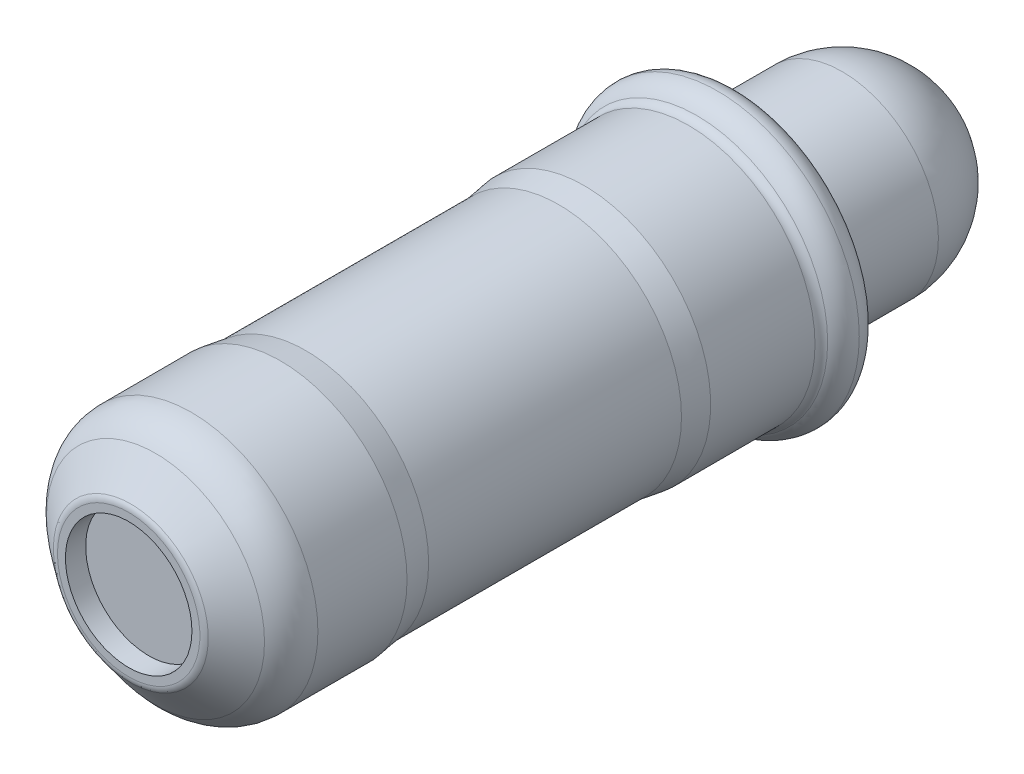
ISO-10303-21;
HEADER;
FILE_DESCRIPTION(('STEP AP214'),'2;1');
FILE_NAME('part.step','',(''),(''),'','','');
FILE_SCHEMA(('AUTOMOTIVE_DESIGN { 1 0 10303 214 1 1 1 1 }'));
ENDSEC;
DATA;
#1=APPLICATION_CONTEXT('core data for automotive mechanical design processes');
#2=APPLICATION_PROTOCOL_DEFINITION('international standard','automotive_design',2000,#1);
#3=PRODUCT_CONTEXT('',#1,'mechanical');
#4=PRODUCT('Part','Part','',(#3));
#5=PRODUCT_RELATED_PRODUCT_CATEGORY('part','',(#4));
#6=PRODUCT_DEFINITION_FORMATION('','',#4);
#7=PRODUCT_DEFINITION_CONTEXT('part definition',#1,'design');
#8=PRODUCT_DEFINITION('design','',#6,#7);
#9=PRODUCT_DEFINITION_SHAPE('','',#8);
#10=(LENGTH_UNIT() NAMED_UNIT(*) SI_UNIT(.MILLI.,.METRE.));
#11=(NAMED_UNIT(*) PLANE_ANGLE_UNIT() SI_UNIT($,.RADIAN.));
#12=(NAMED_UNIT(*) SI_UNIT($,.STERADIAN.) SOLID_ANGLE_UNIT());
#13=UNCERTAINTY_MEASURE_WITH_UNIT(LENGTH_MEASURE(1.E-05),#10,'distance_accuracy_value','');
#14=(GEOMETRIC_REPRESENTATION_CONTEXT(3) GLOBAL_UNCERTAINTY_ASSIGNED_CONTEXT((#13)) GLOBAL_UNIT_ASSIGNED_CONTEXT((#10,
#11,#12)) REPRESENTATION_CONTEXT('',''));
#15=CARTESIAN_POINT('',(0.,0.,0.));
#16=DIRECTION('',(0.,0.,1.));
#17=DIRECTION('',(1.,0.,0.));
#18=AXIS2_PLACEMENT_3D('',#15,#16,#17);
#19=CARTESIAN_POINT('',(0.,0.,4.));
#20=DIRECTION('',(0.,0.,1.));
#21=DIRECTION('',(1.,0.,0.));
#22=AXIS2_PLACEMENT_3D('',#19,#20,#21);
#23=CYLINDRICAL_SURFACE('',#22,1.25);
#24=CARTESIAN_POINT('',(0.,0.,16.));
#25=DIRECTION('',(0.,0.,1.));
#26=DIRECTION('',(1.,0.,0.));
#27=AXIS2_PLACEMENT_3D('',#24,#25,#26);
#28=CIRCLE('',#27,1.25);
#29=CARTESIAN_POINT('',(1.25,0.,16.));
#30=VERTEX_POINT('',#29);
#31=EDGE_CURVE('E154',#30,#30,#28,.F.);
#32=ORIENTED_EDGE('',*,*,#31,.F.);
#33=EDGE_LOOP('',(#32));
#34=FACE_BOUND('',#33,.T.);
#35=CARTESIAN_POINT('',(0.,0.,15.6));
#36=DIRECTION('',(0.,0.,1.));
#37=DIRECTION('',(1.,0.,0.));
#38=AXIS2_PLACEMENT_3D('',#35,#36,#37);
#39=CIRCLE('',#38,1.25);
#40=CARTESIAN_POINT('',(1.25,0.,15.6));
#41=VERTEX_POINT('',#40);
#42=EDGE_CURVE('E161',#41,#41,#39,.T.);
#43=ORIENTED_EDGE('',*,*,#42,.F.);
#44=EDGE_LOOP('',(#43));
#45=FACE_BOUND('',#44,.T.);
#46=ADVANCED_FACE('F12',(#34,#45),#23,.F.);
#47=CARTESIAN_POINT('',(0.,1.89,4.));
#48=DIRECTION('',(0.,0.,-1.));
#49=DIRECTION('',(-1.,0.,0.));
#50=AXIS2_PLACEMENT_3D('',#47,#48,#49);
#51=PLANE('',#50);
#52=CARTESIAN_POINT('',(0.,0.,4.));
#53=DIRECTION('',(0.,0.,-1.));
#54=DIRECTION('',(-1.,0.,0.));
#55=AXIS2_PLACEMENT_3D('',#52,#53,#54);
#56=CIRCLE('',#55,1.9);
#57=CARTESIAN_POINT('',(-1.9,0.,4.));
#58=VERTEX_POINT('',#57);
#59=EDGE_CURVE('E15',#58,#58,#56,.F.);
#60=ORIENTED_EDGE('',*,*,#59,.T.);
#61=EDGE_LOOP('',(#60));
#62=FACE_BOUND('',#61,.T.);
#63=CARTESIAN_POINT('',(0.,0.,4.00000000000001));
#64=DIRECTION('',(0.,0.,1.));
#65=DIRECTION('',(-1.,0.,0.));
#66=AXIS2_PLACEMENT_3D('',#63,#64,#65);
#67=CIRCLE('',#66,2.53126609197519);
#68=CARTESIAN_POINT('',(-2.53126609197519,0.,4.00000000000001));
#69=VERTEX_POINT('',#68);
#70=EDGE_CURVE('E150',#69,#69,#67,.T.);
#71=ORIENTED_EDGE('',*,*,#70,.F.);
#72=EDGE_LOOP('',(#71));
#73=FACE_BOUND('',#72,.T.);
#74=ADVANCED_FACE('F132',(#62,#73),#51,.T.);
#75=CARTESIAN_POINT('',(0.,1.4071811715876,16.));
#76=DIRECTION('',(0.,0.,1.));
#77=DIRECTION('',(1.,0.,0.));
#78=AXIS2_PLACEMENT_3D('',#75,#76,#77);
#79=PLANE('',#78);
#80=CARTESIAN_POINT('',(0.,0.,16.));
#81=DIRECTION('',(0.,0.,-1.));
#82=DIRECTION('',(-1.,0.,0.));
#83=AXIS2_PLACEMENT_3D('',#80,#81,#82);
#84=CIRCLE('',#83,1.40718117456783);
#85=CARTESIAN_POINT('',(-1.40718117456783,0.,16.));
#86=VERTEX_POINT('',#85);
#87=EDGE_CURVE('E120',#86,#86,#84,.T.);
#88=ORIENTED_EDGE('',*,*,#87,.F.);
#89=EDGE_LOOP('',(#88));
#90=FACE_BOUND('',#89,.T.);
#91=ORIENTED_EDGE('',*,*,#31,.T.);
#92=EDGE_LOOP('',(#91));
#93=FACE_BOUND('',#92,.T.);
#94=ADVANCED_FACE('F124',(#90,#93),#79,.T.);
#95=CARTESIAN_POINT('',(0.,0.,4.1999999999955));
#96=DIRECTION('',(0.,0.,-1.));
#97=DIRECTION('',(-1.,0.,0.));
#98=AXIS2_PLACEMENT_3D('',#95,#96,#97);
#99=TOROIDAL_SURFACE('',#98,2.53126743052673,0.199999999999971);
#100=ORIENTED_EDGE('',*,*,#70,.T.);
#101=EDGE_LOOP('',(#100));
#102=FACE_BOUND('',#101,.T.);
#103=CARTESIAN_POINT('',(0.,0.,4.059));
#104=DIRECTION('',(0.,0.,-1.));
#105=DIRECTION('',(-1.,0.,0.));
#106=AXIS2_PLACEMENT_3D('',#103,#104,#105);
#107=CIRCLE('',#106,2.67310889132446);
#108=CARTESIAN_POINT('',(-2.67310889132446,0.,4.059));
#109=VERTEX_POINT('',#108);
#110=EDGE_CURVE('E89',#109,#109,#107,.F.);
#111=ORIENTED_EDGE('',*,*,#110,.F.);
#112=EDGE_LOOP('',(#111));
#113=FACE_BOUND('',#112,.T.);
#114=ADVANCED_FACE('F106',(#102,#113),#99,.T.);
#115=CARTESIAN_POINT('',(0.,0.,15.8));
#116=DIRECTION('',(0.,0.,-1.));
#117=DIRECTION('',(-1.,0.,0.));
#118=AXIS2_PLACEMENT_3D('',#115,#116,#117);
#119=TOROIDAL_SURFACE('',#118,1.4071811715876,0.2);
#120=CARTESIAN_POINT('',(0.,0.,15.9576021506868));
#121=DIRECTION('',(0.,0.,-1.));
#122=DIRECTION('',(-1.,0.,0.));
#123=AXIS2_PLACEMENT_3D('',#120,#121,#122);
#124=CIRCLE('',#123,1.53031346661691);
#125=CARTESIAN_POINT('',(-1.53031346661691,0.,15.9576021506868));
#126=VERTEX_POINT('',#125);
#127=EDGE_CURVE('E84',#126,#126,#124,.T.);
#128=ORIENTED_EDGE('',*,*,#127,.F.);
#129=EDGE_LOOP('',(#128));
#130=FACE_BOUND('',#129,.T.);
#131=ORIENTED_EDGE('',*,*,#87,.T.);
#132=EDGE_LOOP('',(#131));
#133=FACE_BOUND('',#132,.T.);
#134=ADVANCED_FACE('F100',(#130,#133),#119,.T.);
#135=CARTESIAN_POINT('',(0.,0.,4.364));
#136=DIRECTION('',(0.,0.,-1.));
#137=DIRECTION('',(-1.,0.,0.));
#138=AXIS2_PLACEMENT_3D('',#135,#136,#137);
#139=TOROIDAL_SURFACE('',#138,2.37,0.43);
#140=ORIENTED_EDGE('',*,*,#110,.T.);
#141=EDGE_LOOP('',(#140));
#142=FACE_BOUND('',#141,.T.);
#143=CARTESIAN_POINT('',(0.,0.,4.364));
#144=DIRECTION('',(0.,0.,-1.));
#145=DIRECTION('',(-1.,0.,0.));
#146=AXIS2_PLACEMENT_3D('',#143,#144,#145);
#147=CIRCLE('',#146,2.8);
#148=CARTESIAN_POINT('',(-2.8,0.,4.364));
#149=VERTEX_POINT('',#148);
#150=EDGE_CURVE('E78',#149,#149,#147,.F.);
#151=ORIENTED_EDGE('',*,*,#150,.F.);
#152=EDGE_LOOP('',(#151));
#153=FACE_BOUND('',#152,.T.);
#154=ADVANCED_FACE('F96',(#142,#153),#139,.T.);
#155=CARTESIAN_POINT('',(0.,0.,15.4702503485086));
#156=DIRECTION('',(0.,0.,-1.));
#157=DIRECTION('',(-1.,0.,0.));
#158=AXIS2_PLACEMENT_3D('',#155,#156,#157);
#159=CONICAL_SURFACE('',#158,2.15409532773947,0.907571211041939);
#160=CARTESIAN_POINT('',(0.,0.,15.4702503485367));
#161=DIRECTION('',(0.,0.,-1.));
#162=DIRECTION('',(-1.,0.,0.));
#163=AXIS2_PLACEMENT_3D('',#160,#161,#162);
#164=CIRCLE('',#163,2.15409532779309);
#165=CARTESIAN_POINT('',(-2.15409532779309,0.,15.4702503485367));
#166=VERTEX_POINT('',#165);
#167=EDGE_CURVE('E75',#166,#166,#164,.T.);
#168=ORIENTED_EDGE('',*,*,#167,.F.);
#169=EDGE_LOOP('',(#168));
#170=FACE_BOUND('',#169,.T.);
#171=ORIENTED_EDGE('',*,*,#127,.T.);
#172=EDGE_LOOP('',(#171));
#173=FACE_BOUND('',#172,.T.);
#174=ADVANCED_FACE('F99',(#170,#173),#159,.T.);
#175=CARTESIAN_POINT('',(0.,0.,4.364));
#176=DIRECTION('',(0.,0.,-1.));
#177=DIRECTION('',(-1.,0.,0.));
#178=AXIS2_PLACEMENT_3D('',#175,#176,#177);
#179=TOROIDAL_SURFACE('',#178,2.3,0.50000000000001);
#180=ORIENTED_EDGE('',*,*,#150,.T.);
#181=EDGE_LOOP('',(#180));
#182=FACE_BOUND('',#181,.T.);
#183=CARTESIAN_POINT('',(0.,0.,4.77432590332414));
#184=DIRECTION('',(0.,0.,-1.));
#185=DIRECTION('',(-1.,0.,0.));
#186=AXIS2_PLACEMENT_3D('',#183,#184,#185);
#187=CIRCLE('',#186,2.58571428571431);
#188=CARTESIAN_POINT('',(-2.58571428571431,0.,4.77432590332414));
#189=VERTEX_POINT('',#188);
#190=EDGE_CURVE('E50',#189,#189,#187,.T.);
#191=ORIENTED_EDGE('',*,*,#190,.T.);
#192=EDGE_LOOP('',(#191));
#193=FACE_BOUND('',#192,.T.);
#194=ADVANCED_FACE('F68',(#182,#193),#179,.T.);
#195=CARTESIAN_POINT('',(0.,0.,14.7610406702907));
#196=DIRECTION('',(0.,0.,-1.));
#197=DIRECTION('',(-1.,0.,0.));
#198=AXIS2_PLACEMENT_3D('',#195,#196,#197);
#199=TOROIDAL_SURFACE('',#198,1.6,0.9);
#200=CARTESIAN_POINT('',(0.,0.,14.7610406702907));
#201=DIRECTION('',(0.,0.,1.));
#202=DIRECTION('',(1.,0.,0.));
#203=AXIS2_PLACEMENT_3D('',#200,#201,#202);
#204=CIRCLE('',#203,2.5);
#205=CARTESIAN_POINT('',(2.5,0.,14.7610406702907));
#206=VERTEX_POINT('',#205);
#207=EDGE_CURVE('E45',#206,#206,#204,.F.);
#208=ORIENTED_EDGE('',*,*,#207,.F.);
#209=EDGE_LOOP('',(#208));
#210=FACE_BOUND('',#209,.T.);
#211=ORIENTED_EDGE('',*,*,#167,.T.);
#212=EDGE_LOOP('',(#211));
#213=FACE_BOUND('',#212,.T.);
#214=ADVANCED_FACE('F62',(#210,#213),#199,.T.);
#215=CARTESIAN_POINT('',(0.,0.,4.9384562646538));
#216=DIRECTION('',(0.,0.,-1.));
#217=DIRECTION('',(-1.,0.,0.));
#218=AXIS2_PLACEMENT_3D('',#215,#216,#217);
#219=TOROIDAL_SURFACE('',#218,2.7,0.199999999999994);
#220=CARTESIAN_POINT('',(0.,0.,4.9384562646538));
#221=DIRECTION('',(0.,0.,1.));
#222=DIRECTION('',(1.,0.,0.));
#223=AXIS2_PLACEMENT_3D('',#220,#221,#222);
#224=CIRCLE('',#223,2.5);
#225=CARTESIAN_POINT('',(2.5,0.,4.9384562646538));
#226=VERTEX_POINT('',#225);
#227=EDGE_CURVE('E40',#226,#226,#224,.T.);
#228=ORIENTED_EDGE('',*,*,#227,.F.);
#229=EDGE_LOOP('',(#228));
#230=FACE_BOUND('',#229,.T.);
#231=ORIENTED_EDGE('',*,*,#190,.F.);
#232=EDGE_LOOP('',(#231));
#233=FACE_BOUND('',#232,.T.);
#234=ADVANCED_FACE('F57',(#230,#233),#219,.F.);
#235=CARTESIAN_POINT('',(0.,0.,4.));
#236=DIRECTION('',(0.,0.,1.));
#237=DIRECTION('',(1.,0.,0.));
#238=AXIS2_PLACEMENT_3D('',#235,#236,#237);
#239=CYLINDRICAL_SURFACE('',#238,2.5);
#240=CARTESIAN_POINT('',(0.,0.,13.0000000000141));
#241=DIRECTION('',(0.,0.,1.));
#242=DIRECTION('',(1.,0.,0.));
#243=AXIS2_PLACEMENT_3D('',#240,#241,#242);
#244=CIRCLE('',#243,2.50000000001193);
#245=CARTESIAN_POINT('',(2.50000000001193,0.,13.0000000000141));
#246=VERTEX_POINT('',#245);
#247=EDGE_CURVE('E35',#246,#246,#244,.F.);
#248=ORIENTED_EDGE('',*,*,#247,.F.);
#249=EDGE_LOOP('',(#248));
#250=FACE_BOUND('',#249,.T.);
#251=ORIENTED_EDGE('',*,*,#207,.T.);
#252=EDGE_LOOP('',(#251));
#253=FACE_BOUND('',#252,.T.);
#254=ADVANCED_FACE('F61',(#250,#253),#239,.T.);
#255=CARTESIAN_POINT('',(0.,0.,4.));
#256=DIRECTION('',(0.,0.,1.));
#257=DIRECTION('',(1.,0.,0.));
#258=AXIS2_PLACEMENT_3D('',#255,#256,#257);
#259=CYLINDRICAL_SURFACE('',#258,2.5);
#260=ORIENTED_EDGE('',*,*,#227,.T.);
#261=EDGE_LOOP('',(#260));
#262=FACE_BOUND('',#261,.T.);
#263=CARTESIAN_POINT('',(0.,0.,6.99999999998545));
#264=DIRECTION('',(0.,0.,-1.));
#265=DIRECTION('',(-1.,0.,0.));
#266=AXIS2_PLACEMENT_3D('',#263,#264,#265);
#267=CIRCLE('',#266,2.49999999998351);
#268=CARTESIAN_POINT('',(-2.49999999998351,0.,6.99999999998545));
#269=VERTEX_POINT('',#268);
#270=EDGE_CURVE('E24',#269,#269,#267,.F.);
#271=ORIENTED_EDGE('',*,*,#270,.F.);
#272=EDGE_LOOP('',(#271));
#273=FACE_BOUND('',#272,.T.);
#274=ADVANCED_FACE('F242',(#262,#273),#259,.T.);
#275=CARTESIAN_POINT('',(0.,0.,12.9999999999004));
#276=DIRECTION('',(0.,0.,1.));
#277=DIRECTION('',(1.,0.,0.));
#278=AXIS2_PLACEMENT_3D('',#275,#276,#277);
#279=CONICAL_SURFACE('',#278,2.49999999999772,0.148352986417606);
#280=CARTESIAN_POINT('',(0.,0.,12.4981632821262));
#281=DIRECTION('',(0.,0.,1.));
#282=DIRECTION('',(1.,0.,0.));
#283=AXIS2_PLACEMENT_3D('',#280,#281,#282);
#284=CIRCLE('',#283,2.425);
#285=CARTESIAN_POINT('',(2.425,0.,12.4981632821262));
#286=VERTEX_POINT('',#285);
#287=EDGE_CURVE('E19',#286,#286,#284,.F.);
#288=ORIENTED_EDGE('',*,*,#287,.F.);
#289=EDGE_LOOP('',(#288));
#290=FACE_BOUND('',#289,.T.);
#291=ORIENTED_EDGE('',*,*,#247,.T.);
#292=EDGE_LOOP('',(#291));
#293=FACE_BOUND('',#292,.T.);
#294=ADVANCED_FACE('F249',(#290,#293),#279,.T.);
#295=CARTESIAN_POINT('',(0.,0.,6.9999999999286));
#296=DIRECTION('',(0.,0.,-1.));
#297=DIRECTION('',(-1.,0.,0.));
#298=AXIS2_PLACEMENT_3D('',#295,#296,#297);
#299=CONICAL_SURFACE('',#298,2.49999999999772,0.148352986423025);
#300=ORIENTED_EDGE('',*,*,#270,.T.);
#301=EDGE_LOOP('',(#300));
#302=FACE_BOUND('',#301,.T.);
#303=CARTESIAN_POINT('',(0.,0.,7.50183671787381));
#304=DIRECTION('',(0.,0.,1.));
#305=DIRECTION('',(1.,0.,0.));
#306=AXIS2_PLACEMENT_3D('',#303,#304,#305);
#307=CIRCLE('',#306,2.425);
#308=CARTESIAN_POINT('',(2.425,0.,7.50183671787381));
#309=VERTEX_POINT('',#308);
#310=EDGE_CURVE('E8',#309,#309,#307,.T.);
#311=ORIENTED_EDGE('',*,*,#310,.F.);
#312=EDGE_LOOP('',(#311));
#313=FACE_BOUND('',#312,.T.);
#314=ADVANCED_FACE('F184',(#302,#313),#299,.T.);
#315=CARTESIAN_POINT('',(0.,0.,4.));
#316=DIRECTION('',(0.,0.,1.));
#317=DIRECTION('',(1.,0.,0.));
#318=AXIS2_PLACEMENT_3D('',#315,#316,#317);
#319=CYLINDRICAL_SURFACE('',#318,2.425);
#320=ORIENTED_EDGE('',*,*,#310,.T.);
#321=EDGE_LOOP('',(#320));
#322=FACE_BOUND('',#321,.T.);
#323=ORIENTED_EDGE('',*,*,#287,.T.);
#324=EDGE_LOOP('',(#323));
#325=FACE_BOUND('',#324,.T.);
#326=ADVANCED_FACE('F174',(#322,#325),#319,.T.);
#327=CARTESIAN_POINT('',(0.,0.,1.9));
#328=DIRECTION('',(0.,0.,1.));
#329=DIRECTION('',(-1.,0.,0.));
#330=AXIS2_PLACEMENT_3D('',#327,#328,#329);
#331=SPHERICAL_SURFACE('',#330,1.9);
#332=CARTESIAN_POINT('',(0.,0.,1.9));
#333=DIRECTION('',(0.,0.,1.));
#334=DIRECTION('',(1.,0.,0.));
#335=AXIS2_PLACEMENT_3D('',#332,#333,#334);
#336=CIRCLE('',#335,1.9);
#337=CARTESIAN_POINT('',(1.9,0.,1.9));
#338=VERTEX_POINT('',#337);
#339=EDGE_CURVE('E28',#338,#338,#336,.T.);
#340=ORIENTED_EDGE('',*,*,#339,.F.);
#341=EDGE_LOOP('',(#340));
#342=FACE_BOUND('',#341,.T.);
#343=ADVANCED_FACE('F172',(#342),#331,.T.);
#344=CARTESIAN_POINT('',(0.,0.,17.622467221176));
#345=DIRECTION('',(0.,0.,1.));
#346=DIRECTION('',(1.,0.,0.));
#347=AXIS2_PLACEMENT_3D('',#344,#345,#346);
#348=CYLINDRICAL_SURFACE('',#347,1.9);
#349=ORIENTED_EDGE('',*,*,#59,.F.);
#350=EDGE_LOOP('',(#349));
#351=FACE_BOUND('',#350,.T.);
#352=ORIENTED_EDGE('',*,*,#339,.T.);
#353=EDGE_LOOP('',(#352));
#354=FACE_BOUND('',#353,.T.);
#355=ADVANCED_FACE('F170',(#351,#354),#348,.T.);
#356=CARTESIAN_POINT('',(0.,0.,15.6));
#357=DIRECTION('',(0.,0.,-1.));
#358=DIRECTION('',(-1.,0.,0.));
#359=AXIS2_PLACEMENT_3D('',#356,#357,#358);
#360=PLANE('',#359);
#361=ORIENTED_EDGE('',*,*,#42,.T.);
#362=EDGE_LOOP('',(#361));
#363=FACE_BOUND('',#362,.T.);
#364=ADVANCED_FACE('F181',(#363),#360,.F.);
#365=CLOSED_SHELL('',(#46,#74,#94,#114,#134,#154,#174,#194,#214,#234,#254,#274,#294,#314,#326,
#343,#355,#364));
#366=MANIFOLD_SOLID_BREP('B1',#365);
#367=ADVANCED_BREP_SHAPE_REPRESENTATION('',(#18,#366),#14);
#368=SHAPE_DEFINITION_REPRESENTATION(#9,#367);
ENDSEC;
END-ISO-10303-21;
